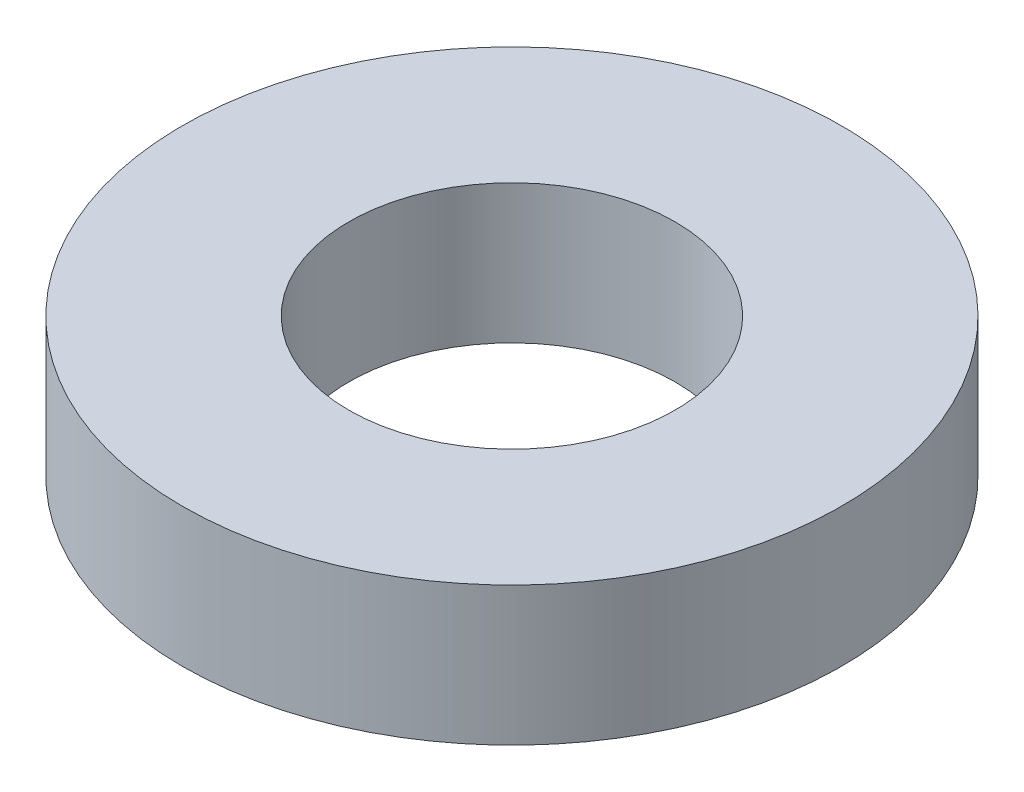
from build123d import *

# Parameters (mm, degrees)
SKETCH_1_R      = 40.4
SKETCH_1_R_2    = 20
EXTRUDE_1_DEPTH = 17


with BuildPart() as part:
    # Sketch 1 → Extrude 1 (new body)
    with BuildSketch(Plane(origin=(0, 0, 0), x_dir=(1, 0, 0), z_dir=(0, 1, 0))):
        with Locations(Location((0, 0, 0), (0, 0, 270))):
            Circle(SKETCH_1_R)
        with Locations(Location((0, 0, 0), (0, 0, 270))):
            Circle(SKETCH_1_R_2, mode=Mode.SUBTRACT)
    extrude(amount=EXTRUDE_1_DEPTH)


solid = part.part
